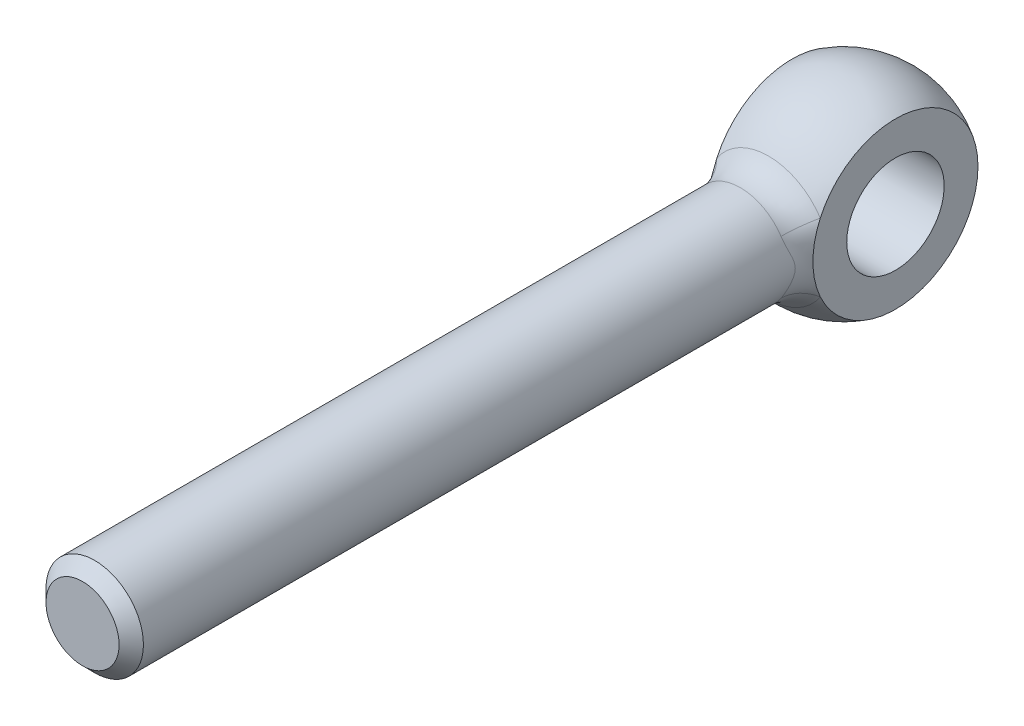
ISO-10303-21;
HEADER;
FILE_DESCRIPTION(('STEP AP214'),'2;1');
FILE_NAME('part.step','',(''),(''),'','','');
FILE_SCHEMA(('AUTOMOTIVE_DESIGN { 1 0 10303 214 1 1 1 1 }'));
ENDSEC;
DATA;
#1=APPLICATION_CONTEXT('core data for automotive mechanical design processes');
#2=APPLICATION_PROTOCOL_DEFINITION('international standard','automotive_design',2000,#1);
#3=PRODUCT_CONTEXT('',#1,'mechanical');
#4=PRODUCT('Part','Part','',(#3));
#5=PRODUCT_RELATED_PRODUCT_CATEGORY('part','',(#4));
#6=PRODUCT_DEFINITION_FORMATION('','',#4);
#7=PRODUCT_DEFINITION_CONTEXT('part definition',#1,'design');
#8=PRODUCT_DEFINITION('design','',#6,#7);
#9=PRODUCT_DEFINITION_SHAPE('','',#8);
#10=(LENGTH_UNIT() NAMED_UNIT(*) SI_UNIT(.MILLI.,.METRE.));
#11=(NAMED_UNIT(*) PLANE_ANGLE_UNIT() SI_UNIT($,.RADIAN.));
#12=(NAMED_UNIT(*) SI_UNIT($,.STERADIAN.) SOLID_ANGLE_UNIT());
#13=UNCERTAINTY_MEASURE_WITH_UNIT(LENGTH_MEASURE(1.E-05),#10,'distance_accuracy_value','');
#14=(GEOMETRIC_REPRESENTATION_CONTEXT(3) GLOBAL_UNCERTAINTY_ASSIGNED_CONTEXT((#13)) GLOBAL_UNIT_ASSIGNED_CONTEXT((#10,
#11,#12)) REPRESENTATION_CONTEXT('',''));
#15=CARTESIAN_POINT('',(0.,0.,0.));
#16=DIRECTION('',(0.,0.,1.));
#17=DIRECTION('',(1.,0.,0.));
#18=AXIS2_PLACEMENT_3D('',#15,#16,#17);
#19=CARTESIAN_POINT('',(0.,0.,0.));
#20=DIRECTION('',(-1.,0.,0.));
#21=DIRECTION('',(0.,0.,-1.));
#22=AXIS2_PLACEMENT_3D('',#19,#20,#21);
#23=SPHERICAL_SURFACE('',#22,16.);
#24=CARTESIAN_POINT('',(8.5,0.,0.));
#25=DIRECTION('',(1.,0.,0.));
#26=DIRECTION('',(0.,0.,1.));
#27=AXIS2_PLACEMENT_3D('',#24,#25,#26);
#28=CIRCLE('',#27,13.555441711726);
#29=CARTESIAN_POINT('',(8.5,5.60530297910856,12.3422274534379));
#30=VERTEX_POINT('',#29);
#31=CARTESIAN_POINT('',(8.5,-5.60530297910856,12.3422274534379));
#32=VERTEX_POINT('',#31);
#33=EDGE_CURVE('E249',#30,#32,#28,.F.);
#34=ORIENTED_EDGE('',*,*,#33,.T.);
#35=CARTESIAN_POINT('',(0.,0.,12.3422274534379));
#36=DIRECTION('',(0.,0.,-1.));
#37=DIRECTION('',(-1.,0.,0.));
#38=AXIS2_PLACEMENT_3D('',#35,#36,#37);
#39=CIRCLE('',#38,10.1818181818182);
#40=CARTESIAN_POINT('',(-8.5,-5.60530297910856,12.3422274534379));
#41=VERTEX_POINT('',#40);
#42=EDGE_CURVE('E72',#32,#41,#39,.T.);
#43=ORIENTED_EDGE('',*,*,#42,.T.);
#44=CARTESIAN_POINT('',(-8.5,0.,0.));
#45=DIRECTION('',(1.,0.,0.));
#46=DIRECTION('',(0.,0.,1.));
#47=AXIS2_PLACEMENT_3D('',#44,#45,#46);
#48=CIRCLE('',#47,13.555441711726);
#49=CARTESIAN_POINT('',(-8.5,5.60530297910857,12.3422274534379));
#50=VERTEX_POINT('',#49);
#51=EDGE_CURVE('E60',#50,#41,#48,.F.);
#52=ORIENTED_EDGE('',*,*,#51,.F.);
#53=CARTESIAN_POINT('',(0.,0.,12.3422274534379));
#54=DIRECTION('',(0.,0.,-1.));
#55=DIRECTION('',(-1.,0.,0.));
#56=AXIS2_PLACEMENT_3D('',#53,#54,#55);
#57=CIRCLE('',#56,10.1818181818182);
#58=EDGE_CURVE('E69',#50,#30,#57,.T.);
#59=ORIENTED_EDGE('',*,*,#58,.T.);
#60=EDGE_LOOP('',(#34,#43,#52,#59));
#61=FACE_BOUND('',#60,.T.);
#62=ADVANCED_FACE('F14',(#61),#23,.T.);
#63=CARTESIAN_POINT('',(0.,0.,-10.));
#64=DIRECTION('',(0.,0.,-1.));
#65=DIRECTION('',(1.,0.,0.));
#66=AXIS2_PLACEMENT_3D('',#63,#64,#65);
#67=CYLINDRICAL_SURFACE('',#66,8.);
#68=CARTESIAN_POINT('',(8.5,7.21404603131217,11.4763905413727));
#69=CARTESIAN_POINT('',(6.09468237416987,5.27266465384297,13.1301049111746));
#70=CARTESIAN_POINT('',(5.37414329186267,5.92609347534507,16.4980627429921));
#71=CARTESIAN_POINT('',(8.5,7.11248168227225,11.5402194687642));
#72=CARTESIAN_POINT('',(6.12063584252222,5.22673391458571,13.2143748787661));
#73=CARTESIAN_POINT('',(5.47521745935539,5.83447064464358,16.5670395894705));
#74=CARTESIAN_POINT('',(8.5,7.00912009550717,11.6033252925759));
#75=CARTESIAN_POINT('',(6.15011431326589,5.17869850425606,13.2964415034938));
#76=CARTESIAN_POINT('',(5.57488056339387,5.73934357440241,16.6279432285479));
#77=CARTESIAN_POINT('',(8.5,6.79823975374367,11.7281301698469));
#78=CARTESIAN_POINT('',(6.21569248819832,5.07719835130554,13.4551021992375));
#79=CARTESIAN_POINT('',(5.77047286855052,5.5426312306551,16.7342322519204));
#80=CARTESIAN_POINT('',(8.5,6.69072095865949,11.7898292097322));
#81=CARTESIAN_POINT('',(6.25173729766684,5.02378952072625,13.5316930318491));
#82=CARTESIAN_POINT('',(5.86640203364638,5.44104589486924,16.7796174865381));
#83=CARTESIAN_POINT('',(8.5,6.47156647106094,11.9115249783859));
#84=CARTESIAN_POINT('',(6.32984302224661,4.91051987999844,13.6784476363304));
#85=CARTESIAN_POINT('',(6.05310068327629,5.23254090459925,16.855289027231));
#86=CARTESIAN_POINT('',(8.5,6.35995651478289,11.9715291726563));
#87=CARTESIAN_POINT('',(6.37181368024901,4.85076320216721,13.7486505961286));
#88=CARTESIAN_POINT('',(6.14389552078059,5.12565346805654,16.8856565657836));
#89=CARTESIAN_POINT('',(8.5,6.13156872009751,12.0900958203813));
#90=CARTESIAN_POINT('',(6.4610620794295,4.72338837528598,13.8824437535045));
#91=CARTESIAN_POINT('',(6.32014497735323,4.90667898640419,16.9324624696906));
#92=CARTESIAN_POINT('',(8.5,6.01479321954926,12.1486589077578));
#93=CARTESIAN_POINT('',(6.50828789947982,4.6558463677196,13.946059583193));
#94=CARTESIAN_POINT('',(6.40560197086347,4.79459429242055,16.9489070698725));
#95=CARTESIAN_POINT('',(8.5,5.84778357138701,12.2293170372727));
#96=CARTESIAN_POINT('',(6.57728162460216,4.55517969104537,14.0300382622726));
#97=CARTESIAN_POINT('',(6.52079058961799,4.6349129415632,16.9628056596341));
#98=CARTESIAN_POINT('',(8.5,5.79993799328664,12.252084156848));
#99=CARTESIAN_POINT('',(6.59714554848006,4.52598470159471,14.0532625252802));
#100=CARTESIAN_POINT('',(6.55301829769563,4.58923484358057,16.9657309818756));
#101=CARTESIAN_POINT('',(8.5,5.70332504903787,12.297354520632));
#102=CARTESIAN_POINT('',(6.63743945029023,4.46617383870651,14.0985544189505));
#103=CARTESIAN_POINT('',(6.61651666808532,4.49720278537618,16.969609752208));
#104=CARTESIAN_POINT('',(8.5,5.65455783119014,12.3198578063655));
#105=CARTESIAN_POINT('',(6.65786724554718,4.43556289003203,14.1206247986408));
#106=CARTESIAN_POINT('',(6.64778748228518,4.45084893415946,16.9705635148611));
#107=CARTESIAN_POINT('',(8.5,5.44499233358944,12.415034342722));
#108=CARTESIAN_POINT('',(6.74556355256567,4.30257834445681,14.2117377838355));
#109=CARTESIAN_POINT('',(6.7787644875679,4.25222888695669,16.9705602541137));
#110=CARTESIAN_POINT('',(8.5,5.27951608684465,12.4864255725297));
#111=CARTESIAN_POINT('',(6.81544368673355,4.19277681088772,14.2754759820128));
#112=CARTESIAN_POINT('',(6.8738000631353,4.09681174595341,16.9604462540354));
#113=CARTESIAN_POINT('',(8.5,4.93715685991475,12.6257147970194));
#114=CARTESIAN_POINT('',(6.95729458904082,3.95635337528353,14.3896247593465));
#115=CARTESIAN_POINT('',(7.052814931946,3.7803320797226,16.9224918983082));
#116=CARTESIAN_POINT('',(8.5,4.76026476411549,12.6936099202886));
#117=CARTESIAN_POINT('',(7.02925378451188,3.82985839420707,14.4401471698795));
#118=CARTESIAN_POINT('',(7.13678522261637,3.61926509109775,16.8946372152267));
#119=CARTESIAN_POINT('',(8.5,4.39291482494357,12.8253889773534));
#120=CARTESIAN_POINT('',(7.17229161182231,3.55899929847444,14.5278930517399));
#121=CARTESIAN_POINT('',(7.29368177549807,3.29171337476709,16.8239398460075));
#122=CARTESIAN_POINT('',(8.5,4.20238277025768,12.8892467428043));
#123=CARTESIAN_POINT('',(7.24340117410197,3.41463018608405,14.5651704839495));
#124=CARTESIAN_POINT('',(7.36653960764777,3.12520218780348,16.7810092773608));
#125=CARTESIAN_POINT('',(8.5,3.80753809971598,13.011354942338));
#126=CARTESIAN_POINT('',(7.38096321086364,3.10891477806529,14.6265101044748));
#127=CARTESIAN_POINT('',(7.50042091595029,2.78863622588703,16.6838597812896));
#128=CARTESIAN_POINT('',(8.5,3.60322970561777,13.069607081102));
#129=CARTESIAN_POINT('',(7.44749590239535,2.94761815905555,14.6507009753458));
#130=CARTESIAN_POINT('',(7.5614479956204,2.61858254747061,16.6296443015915));
#131=CARTESIAN_POINT('',(8.5,3.17298584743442,13.1807823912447));
#132=CARTESIAN_POINT('',(7.57474759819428,2.60343332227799,14.6877992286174));
#133=CARTESIAN_POINT('',(7.6733842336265,2.27017167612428,16.5128228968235));
#134=CARTESIAN_POINT('',(8.5,2.94657965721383,13.2334877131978));
#135=CARTESIAN_POINT('',(7.63536024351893,2.41996241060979,14.7004519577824));
#136=CARTESIAN_POINT('',(7.72392626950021,2.09171968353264,16.4500108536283));
#137=CARTESIAN_POINT('',(8.5,2.47625290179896,13.3295107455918));
#138=CARTESIAN_POINT('',(7.74529937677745,2.0363477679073,14.7158200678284));
#139=CARTESIAN_POINT('',(7.81254675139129,1.73163043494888,16.3242586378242));
#140=CARTESIAN_POINT('',(8.5,2.23231936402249,13.3728214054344));
#141=CARTESIAN_POINT('',(7.7947574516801,1.83605562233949,14.7186001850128));
#142=CARTESIAN_POINT('',(7.85061584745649,1.54999089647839,16.2613184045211));
#143=CARTESIAN_POINT('',(8.5,1.72932083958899,13.4470484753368));
#144=CARTESIAN_POINT('',(7.8788717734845,1.42253007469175,14.7183148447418));
#145=CARTESIAN_POINT('',(7.91382421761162,1.18541297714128,16.1458563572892));
#146=CARTESIAN_POINT('',(8.5,1.47045127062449,13.4780956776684));
#147=CARTESIAN_POINT('',(7.91381483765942,1.20922522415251,14.7153404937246));
#148=CARTESIAN_POINT('',(7.93910079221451,1.00251072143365,16.0932277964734));
#149=CARTESIAN_POINT('',(8.5,1.0714872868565,13.5136874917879));
#150=CARTESIAN_POINT('',(7.95363162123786,0.880715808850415,14.7104020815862));
#151=CARTESIAN_POINT('',(7.96751724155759,0.726106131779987,16.0305359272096));
#152=CARTESIAN_POINT('',(8.5,0.936812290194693,13.5237186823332));
#153=CARTESIAN_POINT('',(7.96480566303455,0.769915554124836,14.7086788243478));
#154=CARTESIAN_POINT('',(7.97540430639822,0.633689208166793,16.0123535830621));
#155=CARTESIAN_POINT('',(8.5,0.664802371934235,13.5398145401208));
#156=CARTESIAN_POINT('',(7.98269305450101,0.546269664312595,14.7056669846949));
#157=CARTESIAN_POINT('',(7.98796994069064,0.448291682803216,15.9827925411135));
#158=CARTESIAN_POINT('',(8.5,0.527468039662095,13.5458800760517));
#159=CARTESIAN_POINT('',(7.98941651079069,0.433369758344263,14.7043770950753));
#160=CARTESIAN_POINT('',(7.99264921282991,0.35531120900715,15.9714123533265));
#161=CARTESIAN_POINT('',(8.5,0.239654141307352,13.5541505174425));
#162=CARTESIAN_POINT('',(7.99857317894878,0.196892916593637,14.7025804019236));
#163=CARTESIAN_POINT('',(7.99901593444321,0.161126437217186,15.9558343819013));
#164=CARTESIAN_POINT('',(8.5,0.0890478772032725,13.555984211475));
#165=CARTESIAN_POINT('',(8.00059991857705,0.0731434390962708,14.7021481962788));
#166=CARTESIAN_POINT('',(8.0004158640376,0.0598937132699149,15.9523278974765));
#167=CARTESIAN_POINT('',(8.5,-0.211895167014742,13.5546208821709));
#168=CARTESIAN_POINT('',(7.99909224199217,-0.174066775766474,14.7024570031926));
#169=CARTESIAN_POINT('',(7.99937082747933,-0.142512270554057,15.9549155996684));
#170=CARTESIAN_POINT('',(8.5,-0.362231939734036,13.5514237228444));
#171=CARTESIAN_POINT('',(7.99555670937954,-0.297606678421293,14.7031982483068));
#172=CARTESIAN_POINT('',(7.99692575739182,-0.243685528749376,15.9610100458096));
#173=CARTESIAN_POINT('',(8.5,-0.660964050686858,13.5401445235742));
#174=CARTESIAN_POINT('',(7.9830580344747,-0.54310062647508,14.7055724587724));
#175=CARTESIAN_POINT('',(7.98821555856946,-0.445703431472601,15.9821361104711));
#176=CARTESIAN_POINT('',(8.5,-0.809356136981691,13.5320551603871));
#177=CARTESIAN_POINT('',(7.97407893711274,-0.665127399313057,14.7072081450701));
#178=CARTESIAN_POINT('',(7.9819447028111,-0.546547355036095,15.9971811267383));
#179=CARTESIAN_POINT('',(8.5,-1.10250796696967,13.5113317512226));
#180=CARTESIAN_POINT('',(7.95100172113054,-0.906226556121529,14.7107414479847));
#181=CARTESIAN_POINT('',(7.96564184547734,-0.74747091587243,16.0347055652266));
#182=CARTESIAN_POINT('',(8.5,-1.24726738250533,13.4986972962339));
#183=CARTESIAN_POINT('',(7.93688956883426,-1.02536545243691,14.712640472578));
#184=CARTESIAN_POINT('',(7.9556095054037,-0.847550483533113,16.0571856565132));
#185=CARTESIAN_POINT('',(8.5,-1.53378246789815,13.4691681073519));
#186=CARTESIAN_POINT('',(7.90378045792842,-1.26114755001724,14.7159214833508));
#187=CARTESIAN_POINT('',(7.93172247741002,-1.0478871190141,16.1079466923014));
#188=CARTESIAN_POINT('',(8.5,-1.67548813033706,13.4522283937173));
#189=CARTESIAN_POINT('',(7.88471399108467,-1.37780407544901,14.7172974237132));
#190=CARTESIAN_POINT('',(7.91782727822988,-1.1481342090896,16.1362882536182));
#191=CARTESIAN_POINT('',(8.5,-1.95382048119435,13.414630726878));
#192=CARTESIAN_POINT('',(7.8422358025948,-1.60676183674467,14.7186738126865));
#193=CARTESIAN_POINT('',(7.88631338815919,-1.34768986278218,16.1966383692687));
#194=CARTESIAN_POINT('',(8.5,-2.09044618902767,13.3939720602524));
#195=CARTESIAN_POINT('',(7.8188022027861,-1.71910774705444,14.7186709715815));
#196=CARTESIAN_POINT('',(7.86869398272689,-1.44699824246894,16.2286476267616));
#197=CARTESIAN_POINT('',(8.5,-2.3584137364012,13.3493943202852));
#198=CARTESIAN_POINT('',(7.76807987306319,-1.93905894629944,14.7165469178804));
#199=CARTESIAN_POINT('',(7.82977168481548,-1.64463169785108,16.2945243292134));
#200=CARTESIAN_POINT('',(8.5,-2.48975818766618,13.3254768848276));
#201=CARTESIAN_POINT('',(7.74077070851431,-2.04670100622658,14.7144201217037));
#202=CARTESIAN_POINT('',(7.80847064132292,-1.74295724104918,16.3283908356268));
#203=CARTESIAN_POINT('',(8.5,-2.74731765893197,13.2747681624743));
#204=CARTESIAN_POINT('',(7.6827657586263,-2.25711370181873,14.707436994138));
#205=CARTESIAN_POINT('',(7.76218797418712,-1.93869867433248,16.3964859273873));
#206=CARTESIAN_POINT('',(8.5,-2.87353234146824,13.2479766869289));
#207=CARTESIAN_POINT('',(7.65204733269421,-2.35990795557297,14.7025700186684));
#208=CARTESIAN_POINT('',(7.73720610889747,-2.03611450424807,16.4307145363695));
#209=CARTESIAN_POINT('',(8.5,-3.20930739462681,13.1718509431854));
#210=CARTESIAN_POINT('',(7.5646325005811,-2.63240368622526,14.6849450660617));
#211=CARTESIAN_POINT('',(7.66441324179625,-2.29923751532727,16.5223425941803));
#212=CARTESIAN_POINT('',(8.5,-3.41408000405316,13.1200716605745));
#213=CARTESIAN_POINT('',(7.50515069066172,-2.79695168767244,14.6690169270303));
#214=CARTESIAN_POINT('',(7.61303164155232,-2.46407698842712,16.5788489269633));
#215=CARTESIAN_POINT('',(8.5,-3.8101120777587,13.0105817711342));
#216=CARTESIAN_POINT('',(7.38026115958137,-3.11070990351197,14.6259549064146));
#217=CARTESIAN_POINT('',(7.49942504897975,-2.79079244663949,16.6841164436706));
#218=CARTESIAN_POINT('',(8.5,-4.0013731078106,12.9528718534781));
#219=CARTESIAN_POINT('',(7.31476500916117,-3.25992435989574,14.5987244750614));
#220=CARTESIAN_POINT('',(7.4372013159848,-2.9526687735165,16.7328785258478));
#221=CARTESIAN_POINT('',(8.5,-4.37000544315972,12.8331713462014));
#222=CARTESIAN_POINT('',(7.18112598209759,-3.5415527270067,14.5324431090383));
#223=CARTESIAN_POINT('',(7.3025070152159,-3.27155812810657,16.8185636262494));
#224=CARTESIAN_POINT('',(8.5,-4.54747917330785,12.7712204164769));
#225=CARTESIAN_POINT('',(7.11294809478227,-3.6740501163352,14.4933793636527));
#226=CARTESIAN_POINT('',(7.2301261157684,-3.42860043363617,16.8555818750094));
#227=CARTESIAN_POINT('',(8.5,-4.89131268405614,12.6435234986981));
#228=CARTESIAN_POINT('',(6.97624175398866,-3.92367860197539,14.4030930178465));
#229=CARTESIAN_POINT('',(7.07492374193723,-3.73837581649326,16.9153731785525));
#230=CARTESIAN_POINT('',(8.5,-5.05767311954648,12.5777777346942));
#231=CARTESIAN_POINT('',(6.90769393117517,-4.04071118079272,14.3517578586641));
#232=CARTESIAN_POINT('',(6.99210288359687,-3.89110914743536,16.938147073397));
#233=CARTESIAN_POINT('',(8.5,-5.36183242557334,12.4508919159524));
#234=CARTESIAN_POINT('',(6.78083422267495,-4.24724413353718,14.243801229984));
#235=CARTESIAN_POINT('',(6.8264689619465,-4.17409181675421,16.9653278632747));
#236=CARTESIAN_POINT('',(8.5,-5.5007230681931,12.3900837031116));
#237=CARTESIAN_POINT('',(6.72220835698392,-4.3383567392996,14.1883306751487));
#238=CARTESIAN_POINT('',(6.74473582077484,-4.3049164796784,16.9715357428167));
#239=CARTESIAN_POINT('',(8.5,-5.77121151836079,12.266426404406));
#240=CARTESIAN_POINT('',(6.60877160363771,-4.50955407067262,14.0685302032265));
#241=CARTESIAN_POINT('',(6.57387157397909,-4.56157646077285,16.969341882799));
#242=CARTESIAN_POINT('',(8.5,-5.90281103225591,12.203577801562));
#243=CARTESIAN_POINT('',(6.55399775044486,-4.58954375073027,14.004143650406));
#244=CARTESIAN_POINT('',(6.48474221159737,-4.6874129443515,16.9609435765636));
#245=CARTESIAN_POINT('',(8.5,-6.16130473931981,12.0751601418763));
#246=CARTESIAN_POINT('',(6.44915440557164,-4.74066397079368,13.866146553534));
#247=CARTESIAN_POINT('',(6.29833410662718,-4.93511082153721,16.9279706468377));
#248=CARTESIAN_POINT('',(8.5,-6.28810151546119,12.0095646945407));
#249=CARTESIAN_POINT('',(6.39923076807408,-4.81153733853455,13.7923798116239));
#250=CARTESIAN_POINT('',(6.2009549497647,-5.05688675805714,16.9031603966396));
#251=CARTESIAN_POINT('',(8.5,-6.53574340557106,11.876602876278));
#252=CARTESIAN_POINT('',(6.3062011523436,-4.94457342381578,13.6370894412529));
#253=CARTESIAN_POINT('',(6.00003403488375,-5.29375902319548,16.8359566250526));
#254=CARTESIAN_POINT('',(8.5,-6.65658306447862,11.8092349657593));
#255=CARTESIAN_POINT('',(6.263172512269,-5.00663411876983,13.5555369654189));
#256=CARTESIAN_POINT('',(5.89648681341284,-5.40884924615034,16.7935473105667));
#257=CARTESIAN_POINT('',(8.5,-6.77474698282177,11.7410733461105));
#258=CARTESIAN_POINT('',(6.22436009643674,-5.06487398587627,13.4708703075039));
#259=CARTESIAN_POINT('',(5.79035913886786,-5.52012146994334,16.7417712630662));
#260=(BOUNDED_SURFACE() B_SPLINE_SURFACE(3,2,((#68,#69,#70),(#71,#72,#73),(#74,#75,#76),(#77,
#78,#79),(#80,#81,#82),(#83,#84,#85),(#86,#87,#88),(#89,#90,#91),(#92,#93,#94),(#95,#96,#97),
(#98,#99,#100),(#101,#102,#103),(#104,#105,#106),(#107,#108,#109),(#110,#111,#112),(#113,#114,
#115),(#116,#117,#118),(#119,#120,#121),(#122,#123,#124),(#125,#126,#127),(#128,#129,#130),
(#131,#132,#133),(#134,#135,#136),(#137,#138,#139),(#140,#141,#142),(#143,#144,#145),(#146,#147,
#148),(#149,#150,#151),(#152,#153,#154),(#155,#156,#157),(#158,#159,#160),(#161,#162,#163),
(#164,#165,#166),(#167,#168,#169),(#170,#171,#172),(#173,#174,#175),(#176,#177,#178),(#179,#180,
#181),(#182,#183,#184),(#185,#186,#187),(#188,#189,#190),(#191,#192,#193),(#194,#195,#196),
(#197,#198,#199),(#200,#201,#202),(#203,#204,#205),(#206,#207,#208),(#209,#210,#211),(#212,#213,
#214),(#215,#216,#217),(#218,#219,#220),(#221,#222,#223),(#224,#225,#226),(#227,#228,#229),
(#230,#231,#232),(#233,#234,#235),(#236,#237,#238),(#239,#240,#241),(#242,#243,#244),(#245,#246,
#247),(#248,#249,#250),(#251,#252,#253),(#254,#255,#256),(#257,#258,#259)),.UNSPECIFIED.,.F.,
.F.,.F.) B_SPLINE_SURFACE_WITH_KNOTS((4,2,2,2,2,2,2,2,2,2,2,2,2,2,2,2,2,2,2,2,2,2,2,2,2,2,2,2,2,
2,2,4),(3,3),(0.,0.745231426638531,1.49047004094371,2.23163223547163,2.97246235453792,
3.26605012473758,3.55959104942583,4.5149839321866,5.47114937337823,6.43298377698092,
7.39452475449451,8.38551461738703,9.3772456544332,10.3580939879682,10.8478915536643,
11.3375817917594,11.8688190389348,12.4000706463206,12.9321194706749,13.4642161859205,
14.0021186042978,14.5401243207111,15.0778606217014,15.6156322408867,16.5371108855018,
17.4584825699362,18.3721796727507,19.2858228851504,20.0950945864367,20.9041760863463,
21.7251332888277,22.5468288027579),(0.,1.),
.UNSPECIFIED.) GEOMETRIC_REPRESENTATION_ITEM() RATIONAL_B_SPLINE_SURFACE(((1.,0.863427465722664,
1.),(1.,0.865862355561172,1.),(1.,0.868408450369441,1.),(1.,0.87370086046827,1.),(1.,
0.876447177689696,1.),(1.,0.882102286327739,1.),(1.,0.885010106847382,1.),(1.,0.890964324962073,
1.),(1.,0.894010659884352,1.),(1.,0.898329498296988,1.),(1.,0.89956260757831,1.),(1.,
0.902040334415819,1.),(1.,0.903284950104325,1.),(1.,0.90859944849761,1.),(1.,0.912712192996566,
1.),(1.,0.920912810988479,1.),(1.,0.925000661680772,1.),(1.,0.933046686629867,1.),(1.,
0.937003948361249,1.),(1.,0.944629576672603,1.),(1.,0.948298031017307,1.),(1.,0.955318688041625,
1.),(1.,0.958657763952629,1.),(1.,0.964735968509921,1.),(1.,0.967474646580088,1.),(1.,
0.97215547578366,1.),(1.,0.97410603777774,1.),(1.,0.976336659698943,1.),(1.,0.976964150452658,
1.),(1.,0.977970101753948,1.),(1.,0.978348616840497,1.),(1.,0.978864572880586,1.),(1.,
0.978978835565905,1.),(1.,0.978893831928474,1.),(1.,0.978694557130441,1.),(1.,0.977990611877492,
1.),(1.,0.977485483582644,1.),(1.,0.976189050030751,1.),(1.,0.975397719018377,1.),(1.,
0.973544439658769,1.),(1.,0.972479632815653,1.),(1.,0.970111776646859,1.),(1.,0.968808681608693,
1.),(1.,0.965992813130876,1.),(1.,0.964480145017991,1.),(1.,0.961271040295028,1.),(1.,
0.959574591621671,1.),(1.,0.954755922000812,1.),(1.,0.951480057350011,1.),(1.,0.944585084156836,
1.),(1.,0.940966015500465,1.),(1.,0.933532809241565,1.),(1.,0.929720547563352,1.),(1.,
0.921986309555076,1.),(1.,0.918064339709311,1.),(1.,0.91066816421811,1.),(1.,0.907193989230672,
1.),(1.,0.900316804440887,1.),(1.,0.896913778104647,1.),(1.,0.890194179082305,1.),(1.,
0.886879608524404,1.),(1.,0.88043978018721,1.),(1.,0.877314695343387,1.),(1.,0.874312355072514,1.))) REPRESENTATION_ITEM('') SURFACE());
#261=CARTESIAN_POINT('',(5.79035913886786,-5.52012146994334,16.7417712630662));
#262=CARTESIAN_POINT('',(5.89648681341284,-5.40884924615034,16.7935473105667));
#263=CARTESIAN_POINT('',(6.00003403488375,-5.29375902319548,16.8359566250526));
#264=CARTESIAN_POINT('',(6.2009549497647,-5.05688675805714,16.9031603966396));
#265=CARTESIAN_POINT('',(6.29833410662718,-4.93511082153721,16.9279706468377));
#266=CARTESIAN_POINT('',(6.48474221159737,-4.6874129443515,16.9609435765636));
#267=CARTESIAN_POINT('',(6.57387157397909,-4.56157646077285,16.969341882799));
#268=CARTESIAN_POINT('',(6.74473582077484,-4.3049164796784,16.9715357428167));
#269=CARTESIAN_POINT('',(6.8264689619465,-4.17409181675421,16.9653278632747));
#270=CARTESIAN_POINT('',(6.99210288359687,-3.89110914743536,16.938147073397));
#271=CARTESIAN_POINT('',(7.07492374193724,-3.73837581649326,16.9153731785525));
#272=CARTESIAN_POINT('',(7.2301261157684,-3.42860043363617,16.8555818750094));
#273=CARTESIAN_POINT('',(7.3025070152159,-3.27155812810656,16.8185636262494));
#274=CARTESIAN_POINT('',(7.4372013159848,-2.9526687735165,16.7328785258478));
#275=CARTESIAN_POINT('',(7.49942504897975,-2.79079244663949,16.6841164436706));
#276=CARTESIAN_POINT('',(7.61303164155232,-2.46407698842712,16.5788489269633));
#277=CARTESIAN_POINT('',(7.66441324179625,-2.29923751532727,16.5223425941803));
#278=CARTESIAN_POINT('',(7.73720610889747,-2.03611450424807,16.4307145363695));
#279=CARTESIAN_POINT('',(7.76218797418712,-1.93869867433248,16.3964859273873));
#280=CARTESIAN_POINT('',(7.80847064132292,-1.74295724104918,16.3283908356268));
#281=CARTESIAN_POINT('',(7.82977168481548,-1.64463169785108,16.2945243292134));
#282=CARTESIAN_POINT('',(7.86869398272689,-1.44699824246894,16.2286476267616));
#283=CARTESIAN_POINT('',(7.88631338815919,-1.34768986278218,16.1966383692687));
#284=CARTESIAN_POINT('',(7.91782727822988,-1.1481342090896,16.1362882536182));
#285=CARTESIAN_POINT('',(7.93172247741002,-1.0478871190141,16.1079466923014));
#286=CARTESIAN_POINT('',(7.9556095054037,-0.847550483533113,16.0571856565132));
#287=CARTESIAN_POINT('',(7.96564184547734,-0.74747091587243,16.0347055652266));
#288=CARTESIAN_POINT('',(7.9819447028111,-0.546547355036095,15.9971811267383));
#289=CARTESIAN_POINT('',(7.98821555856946,-0.445703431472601,15.9821361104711));
#290=CARTESIAN_POINT('',(7.99692575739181,-0.243685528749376,15.9610100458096));
#291=CARTESIAN_POINT('',(7.99937082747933,-0.142512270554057,15.9549155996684));
#292=CARTESIAN_POINT('',(8.0004158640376,0.0598937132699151,15.9523278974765));
#293=CARTESIAN_POINT('',(7.99901593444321,0.161126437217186,15.9558343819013));
#294=CARTESIAN_POINT('',(7.99264921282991,0.35531120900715,15.9714123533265));
#295=CARTESIAN_POINT('',(7.98796994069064,0.448291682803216,15.9827925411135));
#296=CARTESIAN_POINT('',(7.97540430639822,0.633689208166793,16.0123535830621));
#297=CARTESIAN_POINT('',(7.96751724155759,0.726106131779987,16.0305359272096));
#298=CARTESIAN_POINT('',(7.93910079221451,1.00251072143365,16.0932277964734));
#299=CARTESIAN_POINT('',(7.91382421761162,1.18541297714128,16.1458563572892));
#300=CARTESIAN_POINT('',(7.85061584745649,1.54999089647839,16.2613184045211));
#301=CARTESIAN_POINT('',(7.81254675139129,1.73163043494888,16.3242586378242));
#302=CARTESIAN_POINT('',(7.72392626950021,2.09171968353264,16.4500108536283));
#303=CARTESIAN_POINT('',(7.6733842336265,2.27017167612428,16.5128228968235));
#304=CARTESIAN_POINT('',(7.5614479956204,2.61858254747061,16.6296443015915));
#305=CARTESIAN_POINT('',(7.50042091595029,2.78863622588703,16.6838597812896));
#306=CARTESIAN_POINT('',(7.36653960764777,3.12520218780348,16.7810092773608));
#307=CARTESIAN_POINT('',(7.29368177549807,3.29171337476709,16.8239398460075));
#308=CARTESIAN_POINT('',(7.13678522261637,3.61926509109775,16.8946372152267));
#309=CARTESIAN_POINT('',(7.052814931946,3.7803320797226,16.9224918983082));
#310=CARTESIAN_POINT('',(6.8738000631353,4.09681174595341,16.9604462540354));
#311=CARTESIAN_POINT('',(6.7787644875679,4.25222888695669,16.9705602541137));
#312=CARTESIAN_POINT('',(6.64778748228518,4.45084893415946,16.9705635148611));
#313=CARTESIAN_POINT('',(6.61651666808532,4.49720278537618,16.969609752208));
#314=CARTESIAN_POINT('',(6.55301829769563,4.58923484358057,16.9657309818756));
#315=CARTESIAN_POINT('',(6.52079058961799,4.6349129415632,16.9628056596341));
#316=CARTESIAN_POINT('',(6.40560197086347,4.79459429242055,16.9489070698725));
#317=CARTESIAN_POINT('',(6.32014497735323,4.90667898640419,16.9324624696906));
#318=CARTESIAN_POINT('',(6.14389552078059,5.12565346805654,16.8856565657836));
#319=CARTESIAN_POINT('',(6.05310068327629,5.23254090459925,16.855289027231));
#320=CARTESIAN_POINT('',(5.86640203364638,5.44104589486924,16.7796174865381));
#321=CARTESIAN_POINT('',(5.77047286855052,5.5426312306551,16.7342322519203));
#322=CARTESIAN_POINT('',(5.57488056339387,5.73934357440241,16.6279432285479));
#323=CARTESIAN_POINT('',(5.47521745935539,5.83447064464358,16.5670395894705));
#324=CARTESIAN_POINT('',(5.37414329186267,5.92609347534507,16.4980627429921));
#325=B_SPLINE_CURVE_WITH_KNOTS('',3,(#261,#262,#263,#264,#265,#266,#267,#268,#269,#270,#271,
#272,#273,#274,#275,#276,#277,#278,#279,#280,#281,#282,#283,#284,#285,#286,#287,#288,#289,#290,
#291,#292,#293,#294,#295,#296,#297,#298,#299,#300,#301,#302,#303,#304,#305,#306,#307,#308,#309,
#310,#311,#312,#313,#314,#315,#316,#317,#318,#319,#320,#321,#322,#323,#324),.UNSPECIFIED.,.F.,
.F.,(4,2,2,2,2,2,2,2,2,2,2,2,2,2,2,2,2,2,2,2,2,2,2,2,2,2,2,2,2,2,2,4),(0.,0.821695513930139,
1.64265271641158,2.45173421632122,3.26100591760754,4.17464913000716,5.08834623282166,
6.00971791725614,6.93119656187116,7.46896818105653,8.0067044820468,8.54471019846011,
9.08261261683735,9.61470933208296,10.1467581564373,10.6780097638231,11.2092470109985,
11.6989372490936,12.1887348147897,13.1695831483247,14.1613141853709,15.1523040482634,
16.113845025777,17.0756794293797,18.0318448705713,18.9872377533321,19.2807786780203,
19.57436644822,20.3151965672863,21.0563587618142,21.8015973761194,22.5468288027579),.UNSPECIFIED.);
#326=CARTESIAN_POINT('',(6.67857142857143,-4.40416662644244,16.9705627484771));
#327=VERTEX_POINT('',#326);
#328=CARTESIAN_POINT('',(6.67857142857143,4.40416662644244,16.9705627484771));
#329=VERTEX_POINT('',#328);
#330=EDGE_CURVE('E85',#327,#329,#325,.T.);
#331=ORIENTED_EDGE('',*,*,#330,.T.);
#332=CARTESIAN_POINT('',(0.,0.,16.9705627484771));
#333=DIRECTION('',(0.,0.,-1.));
#334=DIRECTION('',(-1.,0.,0.));
#335=AXIS2_PLACEMENT_3D('',#332,#333,#334);
#336=CIRCLE('',#335,8.);
#337=CARTESIAN_POINT('',(-6.67857142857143,4.40416662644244,16.9705627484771));
#338=VERTEX_POINT('',#337);
#339=EDGE_CURVE('E9',#329,#338,#336,.F.);
#340=ORIENTED_EDGE('',*,*,#339,.T.);
#341=CARTESIAN_POINT('',(-8.5,-7.21404612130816,11.4763904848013));
#342=CARTESIAN_POINT('',(-6.09468234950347,-5.27266467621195,13.1301048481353));
#343=CARTESIAN_POINT('',(-5.37414329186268,-5.92609347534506,16.4980627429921));
#344=CARTESIAN_POINT('',(-8.5,-7.11248171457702,11.5402194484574));
#345=CARTESIAN_POINT('',(-6.12063583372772,-5.22673392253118,13.2143748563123));
#346=CARTESIAN_POINT('',(-5.47521745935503,-5.8344706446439,16.5670395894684));
#347=CARTESIAN_POINT('',(-8.5,-7.00912010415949,11.603325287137));
#348=CARTESIAN_POINT('',(-6.15011431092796,-5.17869850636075,13.2964414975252));
#349=CARTESIAN_POINT('',(-5.57488056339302,-5.73934357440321,16.6279432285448));
#350=CARTESIAN_POINT('',(-8.5,-6.79823974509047,11.7281301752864));
#351=CARTESIAN_POINT('',(-6.21569249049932,-5.07719834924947,13.4551022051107));
#352=CARTESIAN_POINT('',(-5.77047286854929,-5.54263123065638,16.7342322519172));
#353=CARTESIAN_POINT('',(-8.5,-6.69072095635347,11.789829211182));
#354=CARTESIAN_POINT('',(-6.25173729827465,-5.02378952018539,13.5316930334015));
#355=CARTESIAN_POINT('',(-5.86640203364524,-5.44104589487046,16.7796174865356));
#356=CARTESIAN_POINT('',(-8.5,-6.47156647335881,11.9115249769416));
#357=CARTESIAN_POINT('',(-6.32984302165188,-4.91051988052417,13.6784476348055));
#358=CARTESIAN_POINT('',(-6.05310068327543,-5.23254090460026,16.8552890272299));
#359=CARTESIAN_POINT('',(-8.5,-6.35995651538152,11.97152917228));
#360=CARTESIAN_POINT('',(-6.37181368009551,-4.85076320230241,13.7486505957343));
#361=CARTESIAN_POINT('',(-6.1438955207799,-5.12565346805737,16.8856565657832));
#362=CARTESIAN_POINT('',(-8.5,-6.13156871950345,12.0900958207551));
#363=CARTESIAN_POINT('',(-6.46106207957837,-4.72338837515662,13.8824437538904));
#364=CARTESIAN_POINT('',(-6.3201449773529,-4.90667898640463,16.9324624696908));
#365=CARTESIAN_POINT('',(-8.5,-6.01479321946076,12.1486589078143));
#366=CARTESIAN_POINT('',(-6.50828789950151,-4.65584636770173,13.946059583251));
#367=CARTESIAN_POINT('',(-6.40560197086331,-4.79459429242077,16.9489070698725));
#368=CARTESIAN_POINT('',(-8.5,-5.84778357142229,12.2293170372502));
#369=CARTESIAN_POINT('',(-6.57728162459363,-4.55517969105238,14.0300382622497));
#370=CARTESIAN_POINT('',(-6.52079058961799,-4.6349129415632,16.9628056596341));
#371=CARTESIAN_POINT('',(-8.5,-5.79993799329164,12.252084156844));
#372=CARTESIAN_POINT('',(-6.59714554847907,-4.52598470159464,14.0532625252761));
#373=CARTESIAN_POINT('',(-6.55301829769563,-4.58923484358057,16.9657309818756));
#374=CARTESIAN_POINT('',(-8.5,-5.70332504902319,12.2973545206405));
#375=CARTESIAN_POINT('',(-6.63743945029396,-4.46617383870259,14.098554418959));
#376=CARTESIAN_POINT('',(-6.61651666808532,-4.49720278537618,16.969609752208));
#377=CARTESIAN_POINT('',(-8.5,-5.65455783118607,12.3198578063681));
#378=CARTESIAN_POINT('',(-6.65786724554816,-4.43556289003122,14.1206247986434));
#379=CARTESIAN_POINT('',(-6.64778748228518,-4.45084893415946,16.9705635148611));
#380=CARTESIAN_POINT('',(-8.5,-5.44499233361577,12.4150343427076));
#381=CARTESIAN_POINT('',(-6.74556355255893,-4.30257834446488,14.2117377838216));
#382=CARTESIAN_POINT('',(-6.7787644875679,-4.25222888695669,16.9705602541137));
#383=CARTESIAN_POINT('',(-8.5,-5.27951608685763,12.4864255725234));
#384=CARTESIAN_POINT('',(-6.8154436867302,-4.19277681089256,14.2754759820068));
#385=CARTESIAN_POINT('',(-6.8738000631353,-4.09681174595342,16.9604462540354));
#386=CARTESIAN_POINT('',(-8.5,-4.93715685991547,12.6257147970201));
#387=CARTESIAN_POINT('',(-6.95729458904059,-3.95635337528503,14.3896247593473));
#388=CARTESIAN_POINT('',(-7.052814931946,-3.78033207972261,16.9224918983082));
#389=CARTESIAN_POINT('',(-8.5,-4.7602647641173,12.6936099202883));
#390=CARTESIAN_POINT('',(-7.02925378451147,-3.8298583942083,14.4401471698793));
#391=CARTESIAN_POINT('',(-7.13678522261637,-3.61926509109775,16.8946372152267));
#392=CARTESIAN_POINT('',(-8.5,-4.39291482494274,12.8253889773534));
#393=CARTESIAN_POINT('',(-7.17229161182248,-3.55899929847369,14.5278930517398));
#394=CARTESIAN_POINT('',(-7.29368177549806,-3.29171337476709,16.8239398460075));
#395=CARTESIAN_POINT('',(-8.5,-4.20238277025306,12.8892467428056));
#396=CARTESIAN_POINT('',(-7.24340117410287,-3.41463018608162,14.5651704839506));
#397=CARTESIAN_POINT('',(-7.36653960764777,-3.12520218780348,16.7810092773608));
#398=CARTESIAN_POINT('',(-8.5,-3.80753809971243,13.0113549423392));
#399=CARTESIAN_POINT('',(-7.38096321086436,-3.10891477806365,14.6265101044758));
#400=CARTESIAN_POINT('',(-7.50042091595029,-2.78863622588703,16.6838597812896));
#401=CARTESIAN_POINT('',(-8.5,-3.60322970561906,13.0696070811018));
#402=CARTESIAN_POINT('',(-7.4474959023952,-2.94761815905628,14.6507009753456));
#403=CARTESIAN_POINT('',(-7.56144799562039,-2.61858254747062,16.6296443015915));
#404=CARTESIAN_POINT('',(-8.5,-3.17298584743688,13.1807823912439));
#405=CARTESIAN_POINT('',(-7.57474759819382,-2.60343332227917,14.6877992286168));
#406=CARTESIAN_POINT('',(-7.67338423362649,-2.27017167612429,16.5128228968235));
#407=CARTESIAN_POINT('',(-8.5,-2.94657965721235,13.233487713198));
#408=CARTESIAN_POINT('',(-7.63536024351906,-2.41996241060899,14.7004519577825));
#409=CARTESIAN_POINT('',(-7.7239262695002,-2.09171968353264,16.4500108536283));
#410=CARTESIAN_POINT('',(-8.5,-2.47625290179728,13.3295107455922));
#411=CARTESIAN_POINT('',(-7.74529937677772,-2.03634776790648,14.7158200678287));
#412=CARTESIAN_POINT('',(-7.81254675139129,-1.73163043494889,16.3242586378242));
#413=CARTESIAN_POINT('',(-8.5,-2.23231936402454,13.3728214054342));
#414=CARTESIAN_POINT('',(-7.79475745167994,-1.83605562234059,14.7186001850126));
#415=CARTESIAN_POINT('',(-7.85061584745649,-1.5499908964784,16.2613184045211));
#416=CARTESIAN_POINT('',(-8.5,-1.72932083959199,13.4470484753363));
#417=CARTESIAN_POINT('',(-7.87887177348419,-1.42253007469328,14.7183148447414));
#418=CARTESIAN_POINT('',(-7.91382421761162,-1.18541297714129,16.1458563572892));
#419=CARTESIAN_POINT('',(-8.5,-1.47045127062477,13.4780956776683));
#420=CARTESIAN_POINT('',(-7.91381483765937,-1.20922522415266,14.7153404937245));
#421=CARTESIAN_POINT('',(-7.93910079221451,-1.00251072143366,16.0932277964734));
#422=CARTESIAN_POINT('',(-8.5,-1.07148728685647,13.5136874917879));
#423=CARTESIAN_POINT('',(-7.95363162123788,-0.880715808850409,14.7104020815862));
#424=CARTESIAN_POINT('',(-7.96751724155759,-0.726106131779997,16.0305359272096));
#425=CARTESIAN_POINT('',(-8.5,-0.93681229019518,13.5237186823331));
#426=CARTESIAN_POINT('',(-7.96480566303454,-0.769915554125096,14.7086788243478));
#427=CARTESIAN_POINT('',(-7.97540430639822,-0.633689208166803,16.0123535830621));
#428=CARTESIAN_POINT('',(-8.5,-0.664802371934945,13.5398145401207));
#429=CARTESIAN_POINT('',(-7.98269305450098,-0.546269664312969,14.7056669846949));
#430=CARTESIAN_POINT('',(-7.98796994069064,-0.448291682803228,15.9827925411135));
#431=CARTESIAN_POINT('',(-8.5,-0.527468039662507,13.5458800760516));
#432=CARTESIAN_POINT('',(-7.98941651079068,-0.433369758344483,14.7043770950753));
#433=CARTESIAN_POINT('',(-7.99264921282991,-0.355311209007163,15.9714123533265));
#434=CARTESIAN_POINT('',(-8.5,-0.239654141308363,13.5541505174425));
#435=CARTESIAN_POINT('',(-7.99857317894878,-0.196892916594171,14.7025804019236));
#436=CARTESIAN_POINT('',(-7.9990159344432,-0.161126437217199,15.9558343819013));
#437=CARTESIAN_POINT('',(-8.5,-0.0890478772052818,13.555984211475));
#438=CARTESIAN_POINT('',(-8.00059991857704,-0.073143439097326,14.7021481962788));
#439=CARTESIAN_POINT('',(-8.0004158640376,-0.0598937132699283,15.9523278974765));
#440=CARTESIAN_POINT('',(-8.5,0.211895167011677,13.554620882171));
#441=CARTESIAN_POINT('',(-7.99909224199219,0.17406677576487,14.7024570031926));
#442=CARTESIAN_POINT('',(-7.99937082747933,0.142512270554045,15.9549155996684));
#443=CARTESIAN_POINT('',(-8.5,0.362231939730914,13.5514237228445));
#444=CARTESIAN_POINT('',(-7.99555670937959,0.297606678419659,14.7031982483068));
#445=CARTESIAN_POINT('',(-7.99692575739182,0.243685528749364,15.9610100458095));
#446=CARTESIAN_POINT('',(-8.5,0.660964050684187,13.5401445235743));
#447=CARTESIAN_POINT('',(-7.98305803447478,0.543100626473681,14.7055724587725));
#448=CARTESIAN_POINT('',(-7.98821555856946,0.445703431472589,15.9821361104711));
#449=CARTESIAN_POINT('',(-8.5,0.80935613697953,13.5320551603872));
#450=CARTESIAN_POINT('',(-7.97407893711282,0.665127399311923,14.7072081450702));
#451=CARTESIAN_POINT('',(-7.9819447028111,0.546547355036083,15.9971811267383));
#452=CARTESIAN_POINT('',(-8.5,1.10250796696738,13.5113317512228));
#453=CARTESIAN_POINT('',(-7.95100172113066,0.906226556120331,14.7107414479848));
#454=CARTESIAN_POINT('',(-7.96564184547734,0.747470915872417,16.0347055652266));
#455=CARTESIAN_POINT('',(-8.5,1.2472673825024,13.4986972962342));
#456=CARTESIAN_POINT('',(-7.93688956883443,1.02536545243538,14.7126404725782));
#457=CARTESIAN_POINT('',(-7.9556095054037,0.8475504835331,16.0571856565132));
#458=CARTESIAN_POINT('',(-8.5,1.53378246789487,13.4691681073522));
#459=CARTESIAN_POINT('',(-7.90378045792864,1.26114755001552,14.715921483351));
#460=CARTESIAN_POINT('',(-7.93172247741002,1.04788711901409,16.1079466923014));
#461=CARTESIAN_POINT('',(-8.5,1.67548813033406,13.4522283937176));
#462=CARTESIAN_POINT('',(-7.88471399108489,1.37780407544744,14.7172974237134));
#463=CARTESIAN_POINT('',(-7.91782727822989,1.14813420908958,16.1362882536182));
#464=CARTESIAN_POINT('',(-8.5,1.95382048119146,13.4146307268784));
#465=CARTESIAN_POINT('',(-7.84223580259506,1.60676183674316,14.7186738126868));
#466=CARTESIAN_POINT('',(-7.8863133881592,1.34768986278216,16.1966383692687));
#467=CARTESIAN_POINT('',(-8.5,2.09044618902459,13.3939720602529));
#468=CARTESIAN_POINT('',(-7.81880220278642,1.71910774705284,14.7186709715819));
#469=CARTESIAN_POINT('',(-7.86869398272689,1.44699824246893,16.2286476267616));
#470=CARTESIAN_POINT('',(-8.5,2.3584137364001,13.3493943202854));
#471=CARTESIAN_POINT('',(-7.76807987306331,1.93905894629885,14.7165469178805));
#472=CARTESIAN_POINT('',(-7.82977168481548,1.64463169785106,16.2945243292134));
#473=CARTESIAN_POINT('',(-8.5,2.48975818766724,13.3254768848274));
#474=CARTESIAN_POINT('',(-7.74077070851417,2.04670100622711,14.7144201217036));
#475=CARTESIAN_POINT('',(-7.80847064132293,1.74295724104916,16.3283908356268));
#476=CARTESIAN_POINT('',(-8.5,2.74731765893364,13.274768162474));
#477=CARTESIAN_POINT('',(-7.68276575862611,2.2571137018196,14.7074369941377));
#478=CARTESIAN_POINT('',(-7.76218797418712,1.93869867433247,16.3964859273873));
#479=CARTESIAN_POINT('',(-8.5,2.87353234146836,13.2479766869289));
#480=CARTESIAN_POINT('',(-7.65204733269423,2.35990795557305,14.7025700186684));
#481=CARTESIAN_POINT('',(-7.73720610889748,2.03611450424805,16.4307145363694));
#482=CARTESIAN_POINT('',(-8.5,3.20930739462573,13.1718509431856));
#483=CARTESIAN_POINT('',(-7.56463250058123,2.63240368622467,14.6849450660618));
#484=CARTESIAN_POINT('',(-7.66441324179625,2.29923751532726,16.5223425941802));
#485=CARTESIAN_POINT('',(-8.5,3.4140800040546,13.120071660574));
#486=CARTESIAN_POINT('',(-7.50515069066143,2.79695168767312,14.6690169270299));
#487=CARTESIAN_POINT('',(-7.61303164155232,2.4640769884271,16.5788489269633));
#488=CARTESIAN_POINT('',(-8.5,3.81011207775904,13.0105817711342));
#489=CARTESIAN_POINT('',(-7.38026115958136,3.11070990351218,14.6259549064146));
#490=CARTESIAN_POINT('',(-7.49942504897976,2.79079244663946,16.6841164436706));
#491=CARTESIAN_POINT('',(-8.5,4.00137310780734,12.9528718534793));
#492=CARTESIAN_POINT('',(-7.31476500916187,3.25992435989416,14.5987244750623));
#493=CARTESIAN_POINT('',(-7.43720131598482,2.95266877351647,16.7328785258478));
#494=CARTESIAN_POINT('',(-8.5,4.37000544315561,12.8331713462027));
#495=CARTESIAN_POINT('',(-7.18112598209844,3.54155272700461,14.5324431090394));
#496=CARTESIAN_POINT('',(-7.30250701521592,3.27155812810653,16.8185636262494));
#497=CARTESIAN_POINT('',(-8.5,4.54747917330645,12.7712204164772));
#498=CARTESIAN_POINT('',(-7.11294809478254,3.67405011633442,14.493379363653));
#499=CARTESIAN_POINT('',(-7.23012611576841,3.42860043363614,16.8555818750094));
#500=CARTESIAN_POINT('',(-8.5,4.89131268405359,12.6435234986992));
#501=CARTESIAN_POINT('',(-6.97624175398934,3.92367860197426,14.4030930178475));
#502=CARTESIAN_POINT('',(-7.07492374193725,3.73837581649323,16.9153731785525));
#503=CARTESIAN_POINT('',(-8.5,5.05767311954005,12.5777777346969));
#504=CARTESIAN_POINT('',(-6.90769393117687,4.04071118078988,14.3517578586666));
#505=CARTESIAN_POINT('',(-6.99210288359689,3.89110914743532,16.938147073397));
#506=CARTESIAN_POINT('',(-8.5,5.36183242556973,12.4508919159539));
#507=CARTESIAN_POINT('',(-6.78083422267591,4.24724413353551,14.2438012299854));
#508=CARTESIAN_POINT('',(-6.82646896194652,4.17409181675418,16.9653278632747));
#509=CARTESIAN_POINT('',(-8.5,5.50072306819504,12.3900837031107));
#510=CARTESIAN_POINT('',(-6.72220835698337,4.3383567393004,14.1883306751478));
#511=CARTESIAN_POINT('',(-6.74473582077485,4.30491647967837,16.9715357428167));
#512=CARTESIAN_POINT('',(-8.5,5.7712115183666,12.2664264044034));
#513=CARTESIAN_POINT('',(-6.60877160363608,4.50955407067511,14.0685302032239));
#514=CARTESIAN_POINT('',(-6.57387157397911,4.56157646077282,16.969341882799));
#515=CARTESIAN_POINT('',(-8.5,5.90281103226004,12.20357780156));
#516=CARTESIAN_POINT('',(-6.55399775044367,4.58954375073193,14.0041436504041));
#517=CARTESIAN_POINT('',(-6.48474221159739,4.68741294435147,16.9609435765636));
#518=CARTESIAN_POINT('',(-8.5,6.16130473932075,12.0751601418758));
#519=CARTESIAN_POINT('',(-6.44915440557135,4.74066397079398,13.8661465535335));
#520=CARTESIAN_POINT('',(-6.2983341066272,4.93511082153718,16.9279706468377));
#521=CARTESIAN_POINT('',(-8.5,6.28810151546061,12.009564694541));
#522=CARTESIAN_POINT('',(-6.39923076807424,4.81153733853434,13.7923798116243));
#523=CARTESIAN_POINT('',(-6.20095494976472,5.05688675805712,16.9031603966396));
#524=CARTESIAN_POINT('',(-8.5,6.5357434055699,11.8766028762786));
#525=CARTESIAN_POINT('',(-6.30620115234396,4.94457342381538,13.6370894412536));
#526=CARTESIAN_POINT('',(-6.00003403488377,5.29375902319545,16.8359566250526));
#527=CARTESIAN_POINT('',(-8.5,6.65658306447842,11.8092349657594));
#528=CARTESIAN_POINT('',(-6.26317251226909,5.00663411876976,13.555536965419));
#529=CARTESIAN_POINT('',(-5.89648681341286,5.40884924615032,16.7935473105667));
#530=CARTESIAN_POINT('',(-8.5,6.77474698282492,11.7410733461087));
#531=CARTESIAN_POINT('',(-6.22436009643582,5.06487398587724,13.470870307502));
#532=CARTESIAN_POINT('',(-5.79035913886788,5.52012146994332,16.7417712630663));
#533=(BOUNDED_SURFACE() B_SPLINE_SURFACE(3,2,((#341,#342,#343),(#344,#345,#346),(#347,#348,
#349),(#350,#351,#352),(#353,#354,#355),(#356,#357,#358),(#359,#360,#361),(#362,#363,#364),
(#365,#366,#367),(#368,#369,#370),(#371,#372,#373),(#374,#375,#376),(#377,#378,#379),(#380,#381,
#382),(#383,#384,#385),(#386,#387,#388),(#389,#390,#391),(#392,#393,#394),(#395,#396,#397),
(#398,#399,#400),(#401,#402,#403),(#404,#405,#406),(#407,#408,#409),(#410,#411,#412),(#413,#414,
#415),(#416,#417,#418),(#419,#420,#421),(#422,#423,#424),(#425,#426,#427),(#428,#429,#430),
(#431,#432,#433),(#434,#435,#436),(#437,#438,#439),(#440,#441,#442),(#443,#444,#445),(#446,#447,
#448),(#449,#450,#451),(#452,#453,#454),(#455,#456,#457),(#458,#459,#460),(#461,#462,#463),
(#464,#465,#466),(#467,#468,#469),(#470,#471,#472),(#473,#474,#475),(#476,#477,#478),(#479,#480,
#481),(#482,#483,#484),(#485,#486,#487),(#488,#489,#490),(#491,#492,#493),(#494,#495,#496),
(#497,#498,#499),(#500,#501,#502),(#503,#504,#505),(#506,#507,#508),(#509,#510,#511),(#512,#513,
#514),(#515,#516,#517),(#518,#519,#520),(#521,#522,#523),(#524,#525,#526),(#527,#528,#529),
(#530,#531,#532)),.UNSPECIFIED.,.F.,.F.,.F.) B_SPLINE_SURFACE_WITH_KNOTS((4,2,2,2,2,2,2,2,2,2,2,
2,2,2,2,2,2,2,2,2,2,2,2,2,2,2,2,2,2,2,2,4),(3,3),(0.,0.745231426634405,1.49047004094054,
2.23163223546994,2.97246235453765,3.26605012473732,3.55959104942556,4.51498393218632,
5.47114937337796,6.43298377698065,7.39452475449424,8.38551461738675,9.37724565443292,
10.3580939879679,10.847891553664,11.3375817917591,11.8688190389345,12.4000706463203,
12.9321194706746,13.4642161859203,14.0021186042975,14.5401243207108,15.0778606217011,
15.6156322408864,16.5371108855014,17.4584825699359,18.3721796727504,19.28582288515,
20.0950945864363,20.904176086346,21.7251332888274,22.5468288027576),(0.,1.),
.UNSPECIFIED.) GEOMETRIC_REPRESENTATION_ITEM() RATIONAL_B_SPLINE_SURFACE(((1.,0.863427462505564,
1.),(1.,0.865862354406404,1.),(1.,0.8684084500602,1.),(1.,0.873700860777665,1.),(1.,
0.87644717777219,1.),(1.,0.882102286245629,1.),(1.,0.885010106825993,1.),(1.,0.89096432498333,
1.),(1.,0.894010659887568,1.),(1.,0.898329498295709,1.),(1.,0.899562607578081,1.),(1.,
0.902040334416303,1.),(1.,0.903284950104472,1.),(1.,0.908599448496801,1.),(1.,0.912712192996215,
1.),(1.,0.920912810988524,1.),(1.,0.925000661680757,1.),(1.,0.933046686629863,1.),(1.,
0.937003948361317,1.),(1.,0.944629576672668,1.),(1.,0.948298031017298,1.),(1.,0.955318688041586,
1.),(1.,0.958657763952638,1.),(1.,0.964735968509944,1.),(1.,0.967474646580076,1.),(1.,
0.972155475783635,1.),(1.,0.974106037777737,1.),(1.,0.976336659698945,1.),(1.,0.976964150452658,
1.),(1.,0.977970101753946,1.),(1.,0.978348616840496,1.),(1.,0.978864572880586,1.),(1.,
0.978978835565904,1.),(1.,0.978893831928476,1.),(1.,0.978694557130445,1.),(1.,0.977990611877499,
1.),(1.,0.97748548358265,1.),(1.,0.97618905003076,1.),(1.,0.975397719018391,1.),(1.,
0.973544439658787,1.),(1.,0.972479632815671,1.),(1.,0.970111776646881,1.),(1.,0.968808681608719,
1.),(1.,0.965992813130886,1.),(1.,0.964480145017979,1.),(1.,0.961271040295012,1.),(1.,
0.959574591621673,1.),(1.,0.954755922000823,1.),(1.,0.951480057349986,1.),(1.,0.944585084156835,
1.),(1.,0.940966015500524,1.),(1.,0.933532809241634,1.),(1.,0.929720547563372,1.),(1.,
0.921986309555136,1.),(1.,0.918064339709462,1.),(1.,0.910668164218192,1.),(1.,0.907193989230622,
1.),(1.,0.90031680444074,1.),(1.,0.896913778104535,1.),(1.,0.890194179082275,1.),(1.,
0.886879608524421,1.),(1.,0.880439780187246,1.),(1.,0.877314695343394,1.),(1.,0.874312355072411,1.))) REPRESENTATION_ITEM('') SURFACE());
#534=CARTESIAN_POINT('',(-5.79035913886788,5.52012146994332,16.7417712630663));
#535=CARTESIAN_POINT('',(-5.89648681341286,5.40884924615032,16.7935473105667));
#536=CARTESIAN_POINT('',(-6.00003403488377,5.29375902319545,16.8359566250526));
#537=CARTESIAN_POINT('',(-6.20095494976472,5.05688675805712,16.9031603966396));
#538=CARTESIAN_POINT('',(-6.2983341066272,4.93511082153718,16.9279706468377));
#539=CARTESIAN_POINT('',(-6.48474221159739,4.68741294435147,16.9609435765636));
#540=CARTESIAN_POINT('',(-6.57387157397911,4.56157646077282,16.969341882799));
#541=CARTESIAN_POINT('',(-6.74473582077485,4.30491647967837,16.9715357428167));
#542=CARTESIAN_POINT('',(-6.82646896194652,4.17409181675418,16.9653278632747));
#543=CARTESIAN_POINT('',(-6.99210288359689,3.89110914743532,16.938147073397));
#544=CARTESIAN_POINT('',(-7.07492374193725,3.73837581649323,16.9153731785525));
#545=CARTESIAN_POINT('',(-7.23012611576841,3.42860043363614,16.8555818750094));
#546=CARTESIAN_POINT('',(-7.30250701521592,3.27155812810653,16.8185636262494));
#547=CARTESIAN_POINT('',(-7.43720131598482,2.95266877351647,16.7328785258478));
#548=CARTESIAN_POINT('',(-7.49942504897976,2.79079244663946,16.6841164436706));
#549=CARTESIAN_POINT('',(-7.61303164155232,2.4640769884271,16.5788489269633));
#550=CARTESIAN_POINT('',(-7.66441324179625,2.29923751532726,16.5223425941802));
#551=CARTESIAN_POINT('',(-7.73720610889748,2.03611450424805,16.4307145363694));
#552=CARTESIAN_POINT('',(-7.76218797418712,1.93869867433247,16.3964859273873));
#553=CARTESIAN_POINT('',(-7.80847064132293,1.74295724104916,16.3283908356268));
#554=CARTESIAN_POINT('',(-7.82977168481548,1.64463169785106,16.2945243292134));
#555=CARTESIAN_POINT('',(-7.86869398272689,1.44699824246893,16.2286476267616));
#556=CARTESIAN_POINT('',(-7.8863133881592,1.34768986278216,16.1966383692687));
#557=CARTESIAN_POINT('',(-7.91782727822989,1.14813420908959,16.1362882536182));
#558=CARTESIAN_POINT('',(-7.93172247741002,1.04788711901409,16.1079466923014));
#559=CARTESIAN_POINT('',(-7.9556095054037,0.8475504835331,16.0571856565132));
#560=CARTESIAN_POINT('',(-7.96564184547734,0.747470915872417,16.0347055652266));
#561=CARTESIAN_POINT('',(-7.9819447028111,0.546547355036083,15.9971811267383));
#562=CARTESIAN_POINT('',(-7.98821555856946,0.445703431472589,15.9821361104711));
#563=CARTESIAN_POINT('',(-7.99692575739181,0.243685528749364,15.9610100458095));
#564=CARTESIAN_POINT('',(-7.99937082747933,0.142512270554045,15.9549155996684));
#565=CARTESIAN_POINT('',(-8.0004158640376,-0.0598937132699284,15.9523278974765));
#566=CARTESIAN_POINT('',(-7.9990159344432,-0.161126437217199,15.9558343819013));
#567=CARTESIAN_POINT('',(-7.99264921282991,-0.355311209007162,15.9714123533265));
#568=CARTESIAN_POINT('',(-7.98796994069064,-0.448291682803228,15.9827925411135));
#569=CARTESIAN_POINT('',(-7.97540430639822,-0.633689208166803,16.0123535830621));
#570=CARTESIAN_POINT('',(-7.96751724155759,-0.726106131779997,16.0305359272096));
#571=CARTESIAN_POINT('',(-7.93910079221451,-1.00251072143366,16.0932277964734));
#572=CARTESIAN_POINT('',(-7.91382421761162,-1.18541297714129,16.1458563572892));
#573=CARTESIAN_POINT('',(-7.85061584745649,-1.5499908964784,16.2613184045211));
#574=CARTESIAN_POINT('',(-7.81254675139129,-1.73163043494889,16.3242586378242));
#575=CARTESIAN_POINT('',(-7.7239262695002,-2.09171968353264,16.4500108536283));
#576=CARTESIAN_POINT('',(-7.67338423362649,-2.27017167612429,16.5128228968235));
#577=CARTESIAN_POINT('',(-7.5614479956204,-2.61858254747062,16.6296443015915));
#578=CARTESIAN_POINT('',(-7.50042091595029,-2.78863622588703,16.6838597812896));
#579=CARTESIAN_POINT('',(-7.36653960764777,-3.12520218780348,16.7810092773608));
#580=CARTESIAN_POINT('',(-7.29368177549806,-3.29171337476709,16.8239398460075));
#581=CARTESIAN_POINT('',(-7.13678522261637,-3.61926509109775,16.8946372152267));
#582=CARTESIAN_POINT('',(-7.052814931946,-3.78033207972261,16.9224918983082));
#583=CARTESIAN_POINT('',(-6.8738000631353,-4.09681174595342,16.9604462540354));
#584=CARTESIAN_POINT('',(-6.7787644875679,-4.2522288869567,16.9705602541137));
#585=CARTESIAN_POINT('',(-6.64778748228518,-4.45084893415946,16.9705635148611));
#586=CARTESIAN_POINT('',(-6.61651666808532,-4.49720278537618,16.969609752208));
#587=CARTESIAN_POINT('',(-6.55301829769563,-4.58923484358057,16.9657309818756));
#588=CARTESIAN_POINT('',(-6.52079058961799,-4.6349129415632,16.9628056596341));
#589=CARTESIAN_POINT('',(-6.40560197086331,-4.79459429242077,16.9489070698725));
#590=CARTESIAN_POINT('',(-6.3201449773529,-4.90667898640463,16.9324624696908));
#591=CARTESIAN_POINT('',(-6.1438955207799,-5.12565346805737,16.8856565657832));
#592=CARTESIAN_POINT('',(-6.05310068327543,-5.23254090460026,16.8552890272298));
#593=CARTESIAN_POINT('',(-5.86640203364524,-5.44104589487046,16.7796174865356));
#594=CARTESIAN_POINT('',(-5.77047286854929,-5.54263123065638,16.7342322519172));
#595=CARTESIAN_POINT('',(-5.57488056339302,-5.73934357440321,16.6279432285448));
#596=CARTESIAN_POINT('',(-5.47521745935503,-5.8344706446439,16.5670395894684));
#597=CARTESIAN_POINT('',(-5.37414329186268,-5.92609347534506,16.4980627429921));
#598=B_SPLINE_CURVE_WITH_KNOTS('',3,(#534,#535,#536,#537,#538,#539,#540,#541,#542,#543,#544,
#545,#546,#547,#548,#549,#550,#551,#552,#553,#554,#555,#556,#557,#558,#559,#560,#561,#562,#563,
#564,#565,#566,#567,#568,#569,#570,#571,#572,#573,#574,#575,#576,#577,#578,#579,#580,#581,#582,
#583,#584,#585,#586,#587,#588,#589,#590,#591,#592,#593,#594,#595,#596,#597),.UNSPECIFIED.,.F.,
.F.,(4,2,2,2,2,2,2,2,2,2,2,2,2,2,2,2,2,2,2,2,2,2,2,2,2,2,2,2,2,2,2,4),(0.,0.821695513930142,
1.64265271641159,2.45173421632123,3.26100591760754,4.17464913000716,5.08834623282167,
6.00971791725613,6.93119656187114,7.46896818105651,8.00670448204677,8.54471019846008,
9.08261261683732,9.61470933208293,10.1467581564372,10.6780097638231,11.2092470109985,
11.6989372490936,12.1887348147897,13.1695831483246,14.1613141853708,15.1523040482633,
16.1138450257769,17.0756794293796,18.0318448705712,18.987237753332,19.2807786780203,
19.5743664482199,20.3151965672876,21.056358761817,21.8015973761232,22.5468288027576),.UNSPECIFIED.);
#599=CARTESIAN_POINT('',(-6.67857142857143,-4.40416662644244,16.9705627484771));
#600=VERTEX_POINT('',#599);
#601=EDGE_CURVE('E27',#338,#600,#598,.T.);
#602=ORIENTED_EDGE('',*,*,#601,.T.);
#603=CARTESIAN_POINT('',(0.,0.,16.9705627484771));
#604=DIRECTION('',(0.,0.,-1.));
#605=DIRECTION('',(-1.,0.,0.));
#606=AXIS2_PLACEMENT_3D('',#603,#604,#605);
#607=CIRCLE('',#606,8.);
#608=EDGE_CURVE('E96',#600,#327,#607,.F.);
#609=ORIENTED_EDGE('',*,*,#608,.T.);
#610=EDGE_LOOP('',(#331,#340,#602,#609));
#611=FACE_BOUND('',#610,.T.);
#612=CARTESIAN_POINT('',(0.,0.,123.));
#613=DIRECTION('',(0.,0.,-1.));
#614=DIRECTION('',(1.,0.,0.));
#615=AXIS2_PLACEMENT_3D('',#612,#613,#614);
#616=CIRCLE('',#615,8.);
#617=CARTESIAN_POINT('',(8.,0.,123.));
#618=VERTEX_POINT('',#617);
#619=EDGE_CURVE('E252',#618,#618,#616,.T.);
#620=ORIENTED_EDGE('',*,*,#619,.T.);
#621=EDGE_LOOP('',(#620));
#622=FACE_BOUND('',#621,.T.);
#623=ADVANCED_FACE('F102',(#611,#622),#67,.T.);
#624=CARTESIAN_POINT('',(0.,0.,125.));
#625=DIRECTION('',(0.,0.,-1.));
#626=DIRECTION('',(1.,0.,0.));
#627=AXIS2_PLACEMENT_3D('',#624,#625,#626);
#628=CONICAL_SURFACE('',#627,6.,0.785398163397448);
#629=ORIENTED_EDGE('',*,*,#619,.F.);
#630=EDGE_LOOP('',(#629));
#631=FACE_BOUND('',#630,.T.);
#632=CARTESIAN_POINT('',(0.,0.,125.));
#633=DIRECTION('',(0.,0.,-1.));
#634=DIRECTION('',(1.,0.,0.));
#635=AXIS2_PLACEMENT_3D('',#632,#633,#634);
#636=CIRCLE('',#635,6.);
#637=CARTESIAN_POINT('',(6.,0.,125.));
#638=VERTEX_POINT('',#637);
#639=EDGE_CURVE('E64',#638,#638,#636,.T.);
#640=ORIENTED_EDGE('',*,*,#639,.T.);
#641=EDGE_LOOP('',(#640));
#642=FACE_BOUND('',#641,.T.);
#643=ADVANCED_FACE('F107',(#631,#642),#628,.T.);
#644=CARTESIAN_POINT('',(0.,-6.,125.));
#645=DIRECTION('',(0.,0.,1.));
#646=DIRECTION('',(-1.,0.,0.));
#647=AXIS2_PLACEMENT_3D('',#644,#645,#646);
#648=PLANE('',#647);
#649=ORIENTED_EDGE('',*,*,#639,.F.);
#650=EDGE_LOOP('',(#649));
#651=FACE_BOUND('',#650,.T.);
#652=ADVANCED_FACE('F167',(#651),#648,.T.);
#653=CARTESIAN_POINT('',(-8.5,15.,-19.9999999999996));
#654=DIRECTION('',(1.,0.,0.));
#655=DIRECTION('',(0.,0.,1.));
#656=AXIS2_PLACEMENT_3D('',#653,#654,#655);
#657=PLANE('',#656);
#658=CARTESIAN_POINT('',(-8.5,0.,0.));
#659=DIRECTION('',(1.,0.,0.));
#660=DIRECTION('',(0.,0.,1.));
#661=AXIS2_PLACEMENT_3D('',#658,#659,#660);
#662=CIRCLE('',#661,8.);
#663=CARTESIAN_POINT('',(-8.5,0.,8.));
#664=VERTEX_POINT('',#663);
#665=EDGE_CURVE('E250',#664,#664,#662,.T.);
#666=ORIENTED_EDGE('',*,*,#665,.T.);
#667=EDGE_LOOP('',(#666));
#668=FACE_BOUND('',#667,.T.);
#669=ORIENTED_EDGE('',*,*,#51,.T.);
#670=EDGE_CURVE('E57',#41,#50,#48,.F.);
#671=ORIENTED_EDGE('',*,*,#670,.T.);
#672=EDGE_LOOP('',(#669,#671));
#673=FACE_BOUND('',#672,.T.);
#674=ADVANCED_FACE('F59',(#668,#673),#657,.F.);
#675=CARTESIAN_POINT('',(8.5,15.,-19.9999999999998));
#676=DIRECTION('',(1.,0.,0.));
#677=DIRECTION('',(0.,0.,1.));
#678=AXIS2_PLACEMENT_3D('',#675,#676,#677);
#679=PLANE('',#678);
#680=CARTESIAN_POINT('',(8.5,0.,0.));
#681=DIRECTION('',(1.,0.,0.));
#682=DIRECTION('',(0.,0.,1.));
#683=AXIS2_PLACEMENT_3D('',#680,#681,#682);
#684=CIRCLE('',#683,8.);
#685=CARTESIAN_POINT('',(8.5,0.,8.));
#686=VERTEX_POINT('',#685);
#687=EDGE_CURVE('E77',#686,#686,#684,.T.);
#688=ORIENTED_EDGE('',*,*,#687,.F.);
#689=EDGE_LOOP('',(#688));
#690=FACE_BOUND('',#689,.T.);
#691=ORIENTED_EDGE('',*,*,#33,.F.);
#692=EDGE_CURVE('E245',#32,#30,#28,.F.);
#693=ORIENTED_EDGE('',*,*,#692,.F.);
#694=EDGE_LOOP('',(#691,#693));
#695=FACE_BOUND('',#694,.T.);
#696=ADVANCED_FACE('F109',(#690,#695),#679,.T.);
#697=CARTESIAN_POINT('',(10.,0.,0.));
#698=DIRECTION('',(-1.,0.,0.));
#699=DIRECTION('',(0.,0.,-1.));
#700=AXIS2_PLACEMENT_3D('',#697,#698,#699);
#701=CYLINDRICAL_SURFACE('',#700,8.);
#702=ORIENTED_EDGE('',*,*,#687,.T.);
#703=EDGE_LOOP('',(#702));
#704=FACE_BOUND('',#703,.T.);
#705=ORIENTED_EDGE('',*,*,#665,.F.);
#706=EDGE_LOOP('',(#705));
#707=FACE_BOUND('',#706,.T.);
#708=ADVANCED_FACE('F123',(#704,#707),#701,.F.);
#709=CARTESIAN_POINT('',(-11.6875,-7.70729159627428,16.9705627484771));
#710=DIRECTION('',(0.550520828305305,-0.834821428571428,0.));
#711=DIRECTION('',(0.834821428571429,0.550520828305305,0.));
#712=AXIS2_PLACEMENT_3D('',#709,#710,#711);
#713=CIRCLE('',#712,6.);
#714=EDGE_CURVE('E78',#600,#41,#713,.F.);
#715=ORIENTED_EDGE('',*,*,#714,.F.);
#716=ORIENTED_EDGE('',*,*,#601,.F.);
#717=CARTESIAN_POINT('',(-11.6875,7.70729159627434,16.9705627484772));
#718=DIRECTION('',(-0.550520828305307,-0.834821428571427,0.));
#719=DIRECTION('',(0.834821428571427,-0.550520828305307,0.));
#720=AXIS2_PLACEMENT_3D('',#717,#718,#719);
#721=CIRCLE('',#720,6.);
#722=EDGE_CURVE('E74',#50,#338,#721,.T.);
#723=ORIENTED_EDGE('',*,*,#722,.F.);
#724=ORIENTED_EDGE('',*,*,#670,.F.);
#725=EDGE_LOOP('',(#715,#716,#723,#724));
#726=FACE_BOUND('',#725,.T.);
#727=ADVANCED_FACE('F75',(#726),#533,.F.);
#728=CARTESIAN_POINT('',(0.,0.,16.9705627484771));
#729=DIRECTION('',(0.,0.,-1.));
#730=DIRECTION('',(-1.,0.,0.));
#731=AXIS2_PLACEMENT_3D('',#728,#729,#730);
#732=TOROIDAL_SURFACE('',#731,14.,6.);
#733=ORIENTED_EDGE('',*,*,#722,.T.);
#734=ORIENTED_EDGE('',*,*,#339,.F.);
#735=CARTESIAN_POINT('',(11.6875,7.70729159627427,16.9705627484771));
#736=DIRECTION('',(-0.550520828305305,0.834821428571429,0.));
#737=DIRECTION('',(-0.834821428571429,-0.550520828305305,0.));
#738=AXIS2_PLACEMENT_3D('',#735,#736,#737);
#739=CIRCLE('',#738,6.);
#740=EDGE_CURVE('E82',#30,#329,#739,.T.);
#741=ORIENTED_EDGE('',*,*,#740,.F.);
#742=ORIENTED_EDGE('',*,*,#58,.F.);
#743=EDGE_LOOP('',(#733,#734,#741,#742));
#744=FACE_BOUND('',#743,.T.);
#745=ADVANCED_FACE('F81',(#744),#732,.F.);
#746=CARTESIAN_POINT('',(0.,0.,16.9705627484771));
#747=DIRECTION('',(0.,0.,-1.));
#748=DIRECTION('',(-1.,0.,0.));
#749=AXIS2_PLACEMENT_3D('',#746,#747,#748);
#750=TOROIDAL_SURFACE('',#749,14.,6.);
#751=ORIENTED_EDGE('',*,*,#714,.T.);
#752=ORIENTED_EDGE('',*,*,#42,.F.);
#753=CARTESIAN_POINT('',(11.6875,-7.70729159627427,16.9705627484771));
#754=DIRECTION('',(-0.550520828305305,-0.834821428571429,0.));
#755=DIRECTION('',(0.834821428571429,-0.550520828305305,0.));
#756=AXIS2_PLACEMENT_3D('',#753,#754,#755);
#757=CIRCLE('',#756,6.);
#758=EDGE_CURVE('E133',#327,#32,#757,.T.);
#759=ORIENTED_EDGE('',*,*,#758,.F.);
#760=ORIENTED_EDGE('',*,*,#608,.F.);
#761=EDGE_LOOP('',(#751,#752,#759,#760));
#762=FACE_BOUND('',#761,.T.);
#763=ADVANCED_FACE('F209',(#762),#750,.F.);
#764=ORIENTED_EDGE('',*,*,#740,.T.);
#765=ORIENTED_EDGE('',*,*,#330,.F.);
#766=ORIENTED_EDGE('',*,*,#758,.T.);
#767=ORIENTED_EDGE('',*,*,#692,.T.);
#768=EDGE_LOOP('',(#764,#765,#766,#767));
#769=FACE_BOUND('',#768,.T.);
#770=ADVANCED_FACE('F113',(#769),#260,.F.);
#771=CLOSED_SHELL('',(#62,#623,#643,#652,#674,#696,#708,#727,#745,#763,#770));
#772=MANIFOLD_SOLID_BREP('B1',#771);
#773=ADVANCED_BREP_SHAPE_REPRESENTATION('',(#18,#772),#14);
#774=SHAPE_DEFINITION_REPRESENTATION(#9,#773);
ENDSEC;
END-ISO-10303-21;
